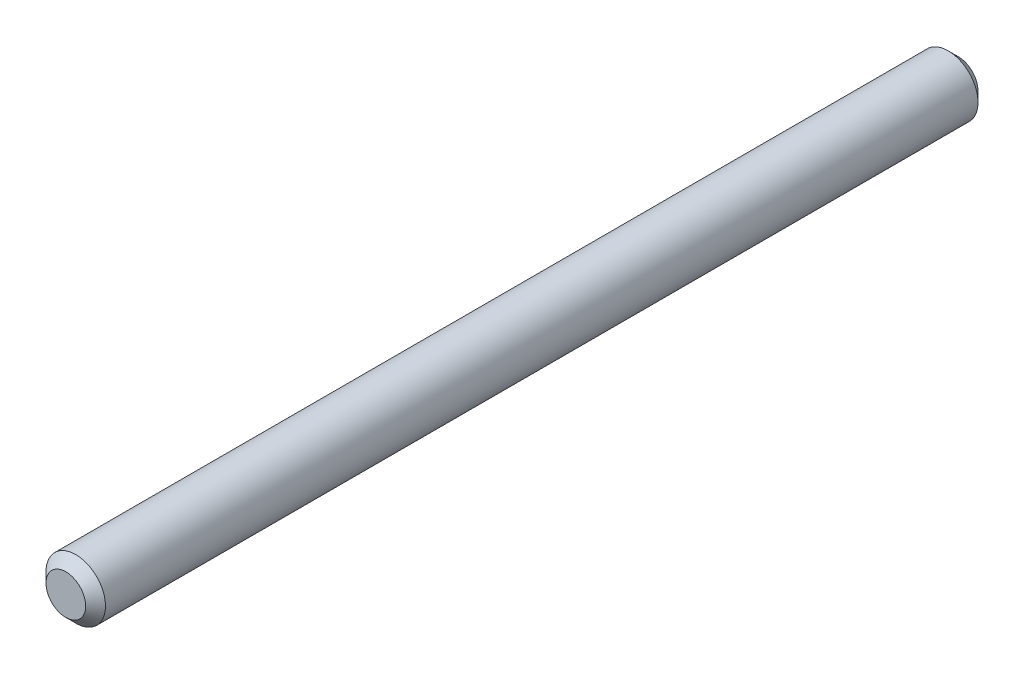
from build123d import *

# Parameters (mm, degrees)
SKETCH_1_R      = 1.5
EXTRUDE_1_DEPTH = 45
CHAMFER_1_SIZE  = 0.5


with BuildPart() as part:
    # Sketch 1 → Extrude 1 (new body)
    with BuildSketch(Plane.XY):
        with Locations(Location((0, 0, 0), (0, 0, 180))):
            Circle(SKETCH_1_R)
    extrude(amount=EXTRUDE_1_DEPTH)

    # Chamfer 1
    chamfer_1_edges = [part.edges().sort_by_distance(p)[0] for p in [
        (1.5, 0, 0),
        (1.5, 0, 45),
    ]]
    chamfer(chamfer_1_edges, length=CHAMFER_1_SIZE)


solid = part.part
